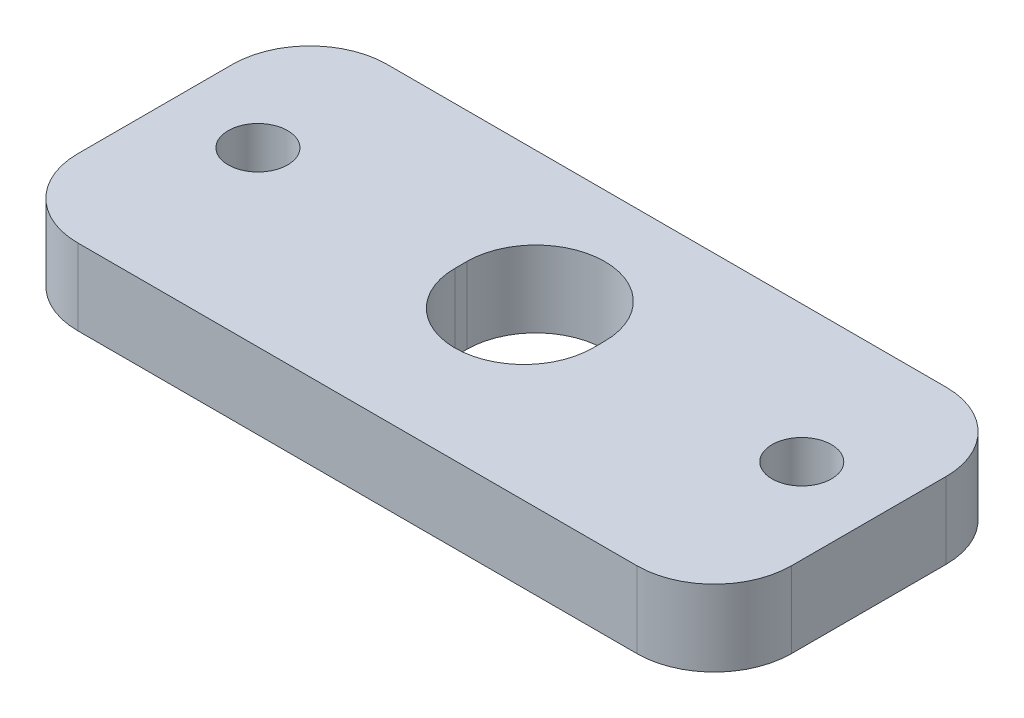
ISO-10303-21;
HEADER;
FILE_DESCRIPTION(('STEP AP214'),'2;1');
FILE_NAME('part.step','',(''),(''),'','','');
FILE_SCHEMA(('AUTOMOTIVE_DESIGN { 1 0 10303 214 1 1 1 1 }'));
ENDSEC;
DATA;
#1=APPLICATION_CONTEXT('core data for automotive mechanical design processes');
#2=APPLICATION_PROTOCOL_DEFINITION('international standard','automotive_design',2000,#1);
#3=PRODUCT_CONTEXT('',#1,'mechanical');
#4=PRODUCT('Part','Part','',(#3));
#5=PRODUCT_RELATED_PRODUCT_CATEGORY('part','',(#4));
#6=PRODUCT_DEFINITION_FORMATION('','',#4);
#7=PRODUCT_DEFINITION_CONTEXT('part definition',#1,'design');
#8=PRODUCT_DEFINITION('design','',#6,#7);
#9=PRODUCT_DEFINITION_SHAPE('','',#8);
#10=(LENGTH_UNIT() NAMED_UNIT(*) SI_UNIT(.MILLI.,.METRE.));
#11=(NAMED_UNIT(*) PLANE_ANGLE_UNIT() SI_UNIT($,.RADIAN.));
#12=(NAMED_UNIT(*) SI_UNIT($,.STERADIAN.) SOLID_ANGLE_UNIT());
#13=UNCERTAINTY_MEASURE_WITH_UNIT(LENGTH_MEASURE(1.E-05),#10,'distance_accuracy_value','');
#14=(GEOMETRIC_REPRESENTATION_CONTEXT(3) GLOBAL_UNCERTAINTY_ASSIGNED_CONTEXT((#13)) GLOBAL_UNIT_ASSIGNED_CONTEXT((#10,
#11,#12)) REPRESENTATION_CONTEXT('',''));
#15=CARTESIAN_POINT('',(0.,0.,0.));
#16=DIRECTION('',(0.,0.,1.));
#17=DIRECTION('',(1.,0.,0.));
#18=AXIS2_PLACEMENT_3D('',#15,#16,#17);
#19=CARTESIAN_POINT('',(0.,3.2,0.));
#20=DIRECTION('',(0.,1.,0.));
#21=DIRECTION('',(0.,0.,1.));
#22=AXIS2_PLACEMENT_3D('',#19,#20,#21);
#23=PLANE('',#22);
#24=CARTESIAN_POINT('',(-11.43,3.2,-0.750000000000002));
#25=DIRECTION('',(0.,1.,0.));
#26=DIRECTION('',(0.,0.,1.));
#27=AXIS2_PLACEMENT_3D('',#24,#25,#26);
#28=CIRCLE('',#27,1.25);
#29=CARTESIAN_POINT('',(-11.43,3.2,0.499999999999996));
#30=VERTEX_POINT('',#29);
#31=EDGE_CURVE('E252',#30,#30,#28,.T.);
#32=ORIENTED_EDGE('',*,*,#31,.F.);
#33=EDGE_LOOP('',(#32));
#34=FACE_BOUND('',#33,.T.);
#35=CARTESIAN_POINT('',(11.43,3.2,-0.750000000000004));
#36=DIRECTION('',(0.,1.,0.));
#37=DIRECTION('',(0.,0.,1.));
#38=AXIS2_PLACEMENT_3D('',#35,#36,#37);
#39=CIRCLE('',#38,1.25);
#40=CARTESIAN_POINT('',(11.43,3.2,0.499999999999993));
#41=VERTEX_POINT('',#40);
#42=EDGE_CURVE('E246',#41,#41,#39,.T.);
#43=ORIENTED_EDGE('',*,*,#42,.F.);
#44=EDGE_LOOP('',(#43));
#45=FACE_BOUND('',#44,.T.);
#46=CARTESIAN_POINT('',(0.,3.2,-0.500000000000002));
#47=DIRECTION('',(0.,1.,0.));
#48=DIRECTION('',(0.,0.,1.));
#49=AXIS2_PLACEMENT_3D('',#46,#47,#48);
#50=CIRCLE('',#49,2.9);
#51=CARTESIAN_POINT('',(-2.9,3.2,-0.5));
#52=VERTEX_POINT('',#51);
#53=CARTESIAN_POINT('',(2.9,3.2,-0.5));
#54=VERTEX_POINT('',#53);
#55=EDGE_CURVE('E160',#52,#54,#50,.T.);
#56=ORIENTED_EDGE('',*,*,#55,.F.);
#57=DIRECTION('',(0.,0.,1.));
#58=VECTOR('',#57,1.);
#59=CARTESIAN_POINT('',(-2.9,3.2,-0.5));
#60=LINE('',#59,#58);
#61=CARTESIAN_POINT('',(-2.9,3.2,-1.));
#62=VERTEX_POINT('',#61);
#63=EDGE_CURVE('E164',#62,#52,#60,.T.);
#64=ORIENTED_EDGE('',*,*,#63,.F.);
#65=CARTESIAN_POINT('',(0.,3.2,-1.));
#66=DIRECTION('',(0.,1.,0.));
#67=DIRECTION('',(0.,0.,1.));
#68=AXIS2_PLACEMENT_3D('',#65,#66,#67);
#69=CIRCLE('',#68,2.9);
#70=CARTESIAN_POINT('',(2.9,3.2,-1.));
#71=VERTEX_POINT('',#70);
#72=EDGE_CURVE('E166',#71,#62,#69,.T.);
#73=ORIENTED_EDGE('',*,*,#72,.F.);
#74=DIRECTION('',(0.,0.,-1.));
#75=VECTOR('',#74,1.);
#76=CARTESIAN_POINT('',(2.9,3.2,-0.5));
#77=LINE('',#76,#75);
#78=EDGE_CURVE('E175',#54,#71,#77,.T.);
#79=ORIENTED_EDGE('',*,*,#78,.F.);
#80=EDGE_LOOP('',(#56,#64,#73,#79));
#81=FACE_BOUND('',#80,.T.);
#82=DIRECTION('',(0.,0.,-1.));
#83=VECTOR('',#82,1.);
#84=CARTESIAN_POINT('',(15.,3.2,6.5));
#85=LINE('',#84,#83);
#86=CARTESIAN_POINT('',(15.,3.2,3.25));
#87=VERTEX_POINT('',#86);
#88=CARTESIAN_POINT('',(15.,3.2,-3.25));
#89=VERTEX_POINT('',#88);
#90=EDGE_CURVE('E233',#87,#89,#85,.T.);
#91=ORIENTED_EDGE('',*,*,#90,.T.);
#92=CARTESIAN_POINT('',(11.75,3.2,-3.25));
#93=DIRECTION('',(0.,1.,0.));
#94=DIRECTION('',(0.,0.,1.));
#95=AXIS2_PLACEMENT_3D('',#92,#93,#94);
#96=CIRCLE('',#95,3.25);
#97=CARTESIAN_POINT('',(11.75,3.2,-6.5));
#98=VERTEX_POINT('',#97);
#99=EDGE_CURVE('E196',#89,#98,#96,.T.);
#100=ORIENTED_EDGE('',*,*,#99,.T.);
#101=DIRECTION('',(-1.,0.,0.));
#102=VECTOR('',#101,1.);
#103=CARTESIAN_POINT('',(15.,3.2,-6.5));
#104=LINE('',#103,#102);
#105=CARTESIAN_POINT('',(-11.75,3.2,-6.5));
#106=VERTEX_POINT('',#105);
#107=EDGE_CURVE('E231',#98,#106,#104,.T.);
#108=ORIENTED_EDGE('',*,*,#107,.T.);
#109=CARTESIAN_POINT('',(-11.75,3.2,-3.25));
#110=DIRECTION('',(0.,1.,0.));
#111=DIRECTION('',(0.,0.,1.));
#112=AXIS2_PLACEMENT_3D('',#109,#110,#111);
#113=CIRCLE('',#112,3.25);
#114=CARTESIAN_POINT('',(-15.,3.2,-3.25));
#115=VERTEX_POINT('',#114);
#116=EDGE_CURVE('E194',#106,#115,#113,.T.);
#117=ORIENTED_EDGE('',*,*,#116,.T.);
#118=DIRECTION('',(0.,0.,1.));
#119=VECTOR('',#118,1.);
#120=CARTESIAN_POINT('',(-15.,3.2,-6.5));
#121=LINE('',#120,#119);
#122=CARTESIAN_POINT('',(-15.,3.2,3.25));
#123=VERTEX_POINT('',#122);
#124=EDGE_CURVE('E229',#115,#123,#121,.T.);
#125=ORIENTED_EDGE('',*,*,#124,.T.);
#126=CARTESIAN_POINT('',(-11.75,3.2,3.25));
#127=DIRECTION('',(0.,1.,0.));
#128=DIRECTION('',(0.,0.,1.));
#129=AXIS2_PLACEMENT_3D('',#126,#127,#128);
#130=CIRCLE('',#129,3.25);
#131=CARTESIAN_POINT('',(-11.75,3.2,6.5));
#132=VERTEX_POINT('',#131);
#133=EDGE_CURVE('E192',#123,#132,#130,.T.);
#134=ORIENTED_EDGE('',*,*,#133,.T.);
#135=DIRECTION('',(1.,0.,0.));
#136=VECTOR('',#135,1.);
#137=CARTESIAN_POINT('',(-15.,3.2,6.5));
#138=LINE('',#137,#136);
#139=CARTESIAN_POINT('',(11.75,3.2,6.5));
#140=VERTEX_POINT('',#139);
#141=EDGE_CURVE('E169',#132,#140,#138,.T.);
#142=ORIENTED_EDGE('',*,*,#141,.T.);
#143=CARTESIAN_POINT('',(11.75,3.2,3.25));
#144=DIRECTION('',(0.,1.,0.));
#145=DIRECTION('',(0.,0.,1.));
#146=AXIS2_PLACEMENT_3D('',#143,#144,#145);
#147=CIRCLE('',#146,3.25);
#148=EDGE_CURVE('E190',#140,#87,#147,.T.);
#149=ORIENTED_EDGE('',*,*,#148,.T.);
#150=EDGE_LOOP('',(#91,#100,#108,#117,#125,#134,#142,#149));
#151=FACE_BOUND('',#150,.T.);
#152=ADVANCED_FACE('F50',(#34,#45,#81,#151),#23,.T.);
#153=CARTESIAN_POINT('',(0.,0.,0.));
#154=DIRECTION('',(0.,1.,0.));
#155=DIRECTION('',(0.,0.,1.));
#156=AXIS2_PLACEMENT_3D('',#153,#154,#155);
#157=PLANE('',#156);
#158=CARTESIAN_POINT('',(-11.43,0.,-0.750000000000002));
#159=DIRECTION('',(0.,1.,0.));
#160=DIRECTION('',(0.,0.,1.));
#161=AXIS2_PLACEMENT_3D('',#158,#159,#160);
#162=CIRCLE('',#161,1.25);
#163=CARTESIAN_POINT('',(-11.43,0.,0.499999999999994));
#164=VERTEX_POINT('',#163);
#165=EDGE_CURVE('E249',#164,#164,#162,.T.);
#166=ORIENTED_EDGE('',*,*,#165,.T.);
#167=EDGE_LOOP('',(#166));
#168=FACE_BOUND('',#167,.T.);
#169=CARTESIAN_POINT('',(11.43,0.,-0.750000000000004));
#170=DIRECTION('',(0.,1.,0.));
#171=DIRECTION('',(0.,0.,1.));
#172=AXIS2_PLACEMENT_3D('',#169,#170,#171);
#173=CIRCLE('',#172,1.25);
#174=CARTESIAN_POINT('',(11.43,0.,0.499999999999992));
#175=VERTEX_POINT('',#174);
#176=EDGE_CURVE('E237',#175,#175,#173,.T.);
#177=ORIENTED_EDGE('',*,*,#176,.T.);
#178=EDGE_LOOP('',(#177));
#179=FACE_BOUND('',#178,.T.);
#180=CARTESIAN_POINT('',(0.,0.,-1.));
#181=DIRECTION('',(0.,1.,0.));
#182=DIRECTION('',(0.,0.,1.));
#183=AXIS2_PLACEMENT_3D('',#180,#181,#182);
#184=CIRCLE('',#183,2.9);
#185=CARTESIAN_POINT('',(2.9,0.,-1.));
#186=VERTEX_POINT('',#185);
#187=CARTESIAN_POINT('',(-2.9,0.,-1.));
#188=VERTEX_POINT('',#187);
#189=EDGE_CURVE('E151',#186,#188,#184,.T.);
#190=ORIENTED_EDGE('',*,*,#189,.T.);
#191=DIRECTION('',(0.,0.,1.));
#192=VECTOR('',#191,1.);
#193=CARTESIAN_POINT('',(-2.9,0.,-0.5));
#194=LINE('',#193,#192);
#195=CARTESIAN_POINT('',(-2.9,0.,-0.5));
#196=VERTEX_POINT('',#195);
#197=EDGE_CURVE('E161',#188,#196,#194,.T.);
#198=ORIENTED_EDGE('',*,*,#197,.T.);
#199=CARTESIAN_POINT('',(0.,0.,-0.500000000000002));
#200=DIRECTION('',(0.,1.,0.));
#201=DIRECTION('',(0.,0.,1.));
#202=AXIS2_PLACEMENT_3D('',#199,#200,#201);
#203=CIRCLE('',#202,2.9);
#204=CARTESIAN_POINT('',(2.9,0.,-0.5));
#205=VERTEX_POINT('',#204);
#206=EDGE_CURVE('E152',#196,#205,#203,.T.);
#207=ORIENTED_EDGE('',*,*,#206,.T.);
#208=DIRECTION('',(0.,0.,-1.));
#209=VECTOR('',#208,1.);
#210=CARTESIAN_POINT('',(2.9,0.,-0.5));
#211=LINE('',#210,#209);
#212=EDGE_CURVE('E141',#205,#186,#211,.T.);
#213=ORIENTED_EDGE('',*,*,#212,.T.);
#214=EDGE_LOOP('',(#190,#198,#207,#213));
#215=FACE_BOUND('',#214,.T.);
#216=DIRECTION('',(1.,0.,0.));
#217=VECTOR('',#216,1.);
#218=CARTESIAN_POINT('',(15.,0.,-6.5));
#219=LINE('',#218,#217);
#220=CARTESIAN_POINT('',(-11.75,0.,-6.5));
#221=VERTEX_POINT('',#220);
#222=CARTESIAN_POINT('',(11.75,0.,-6.5));
#223=VERTEX_POINT('',#222);
#224=EDGE_CURVE('E176',#221,#223,#219,.T.);
#225=ORIENTED_EDGE('',*,*,#224,.T.);
#226=CARTESIAN_POINT('',(11.75,0.,-3.25));
#227=DIRECTION('',(0.,1.,0.));
#228=DIRECTION('',(0.,0.,1.));
#229=AXIS2_PLACEMENT_3D('',#226,#227,#228);
#230=CIRCLE('',#229,3.25);
#231=CARTESIAN_POINT('',(15.,0.,-3.25));
#232=VERTEX_POINT('',#231);
#233=EDGE_CURVE('E208',#223,#232,#230,.F.);
#234=ORIENTED_EDGE('',*,*,#233,.T.);
#235=DIRECTION('',(0.,0.,1.));
#236=VECTOR('',#235,1.);
#237=CARTESIAN_POINT('',(15.,0.,6.5));
#238=LINE('',#237,#236);
#239=CARTESIAN_POINT('',(15.,0.,3.25));
#240=VERTEX_POINT('',#239);
#241=EDGE_CURVE('E238',#232,#240,#238,.T.);
#242=ORIENTED_EDGE('',*,*,#241,.T.);
#243=CARTESIAN_POINT('',(11.75,0.,3.25));
#244=DIRECTION('',(0.,1.,0.));
#245=DIRECTION('',(0.,0.,1.));
#246=AXIS2_PLACEMENT_3D('',#243,#244,#245);
#247=CIRCLE('',#246,3.25);
#248=CARTESIAN_POINT('',(11.75,0.,6.5));
#249=VERTEX_POINT('',#248);
#250=EDGE_CURVE('E203',#240,#249,#247,.F.);
#251=ORIENTED_EDGE('',*,*,#250,.T.);
#252=DIRECTION('',(-1.,0.,0.));
#253=VECTOR('',#252,1.);
#254=CARTESIAN_POINT('',(-15.,0.,6.5));
#255=LINE('',#254,#253);
#256=CARTESIAN_POINT('',(-11.75,0.,6.5));
#257=VERTEX_POINT('',#256);
#258=EDGE_CURVE('E221',#249,#257,#255,.T.);
#259=ORIENTED_EDGE('',*,*,#258,.T.);
#260=CARTESIAN_POINT('',(-11.75,0.,3.25));
#261=DIRECTION('',(0.,1.,0.));
#262=DIRECTION('',(0.,0.,1.));
#263=AXIS2_PLACEMENT_3D('',#260,#261,#262);
#264=CIRCLE('',#263,3.25);
#265=CARTESIAN_POINT('',(-15.,0.,3.25));
#266=VERTEX_POINT('',#265);
#267=EDGE_CURVE('E72',#257,#266,#264,.F.);
#268=ORIENTED_EDGE('',*,*,#267,.T.);
#269=DIRECTION('',(0.,0.,-1.));
#270=VECTOR('',#269,1.);
#271=CARTESIAN_POINT('',(-15.,0.,-6.5));
#272=LINE('',#271,#270);
#273=CARTESIAN_POINT('',(-15.,0.,-3.25));
#274=VERTEX_POINT('',#273);
#275=EDGE_CURVE('E228',#266,#274,#272,.T.);
#276=ORIENTED_EDGE('',*,*,#275,.T.);
#277=CARTESIAN_POINT('',(-11.75,0.,-3.25));
#278=DIRECTION('',(0.,1.,0.));
#279=DIRECTION('',(0.,0.,1.));
#280=AXIS2_PLACEMENT_3D('',#277,#278,#279);
#281=CIRCLE('',#280,3.25);
#282=EDGE_CURVE('E206',#274,#221,#281,.F.);
#283=ORIENTED_EDGE('',*,*,#282,.T.);
#284=EDGE_LOOP('',(#225,#234,#242,#251,#259,#268,#276,#283));
#285=FACE_BOUND('',#284,.T.);
#286=ADVANCED_FACE('F163',(#168,#179,#215,#285),#157,.F.);
#287=CARTESIAN_POINT('',(-2.9,0.,-0.5));
#288=DIRECTION('',(-1.,0.,0.));
#289=DIRECTION('',(0.,0.,1.));
#290=AXIS2_PLACEMENT_3D('',#287,#288,#289);
#291=PLANE('',#290);
#292=ORIENTED_EDGE('',*,*,#63,.T.);
#293=DIRECTION('',(0.,1.,0.));
#294=VECTOR('',#293,1.);
#295=CARTESIAN_POINT('',(-2.9,0.,-0.5));
#296=LINE('',#295,#294);
#297=EDGE_CURVE('E180',#196,#52,#296,.T.);
#298=ORIENTED_EDGE('',*,*,#297,.F.);
#299=ORIENTED_EDGE('',*,*,#197,.F.);
#300=DIRECTION('',(0.,1.,0.));
#301=VECTOR('',#300,1.);
#302=CARTESIAN_POINT('',(-2.9,0.,-1.));
#303=LINE('',#302,#301);
#304=EDGE_CURVE('E183',#188,#62,#303,.T.);
#305=ORIENTED_EDGE('',*,*,#304,.T.);
#306=EDGE_LOOP('',(#292,#298,#299,#305));
#307=FACE_BOUND('',#306,.T.);
#308=ADVANCED_FACE('F269',(#307),#291,.F.);
#309=CARTESIAN_POINT('',(2.9,0.,-0.5));
#310=DIRECTION('',(1.,0.,0.));
#311=DIRECTION('',(0.,0.,-1.));
#312=AXIS2_PLACEMENT_3D('',#309,#310,#311);
#313=PLANE('',#312);
#314=ORIENTED_EDGE('',*,*,#78,.T.);
#315=DIRECTION('',(0.,1.,0.));
#316=VECTOR('',#315,1.);
#317=CARTESIAN_POINT('',(2.9,0.,-1.));
#318=LINE('',#317,#316);
#319=EDGE_CURVE('E147',#186,#71,#318,.T.);
#320=ORIENTED_EDGE('',*,*,#319,.F.);
#321=ORIENTED_EDGE('',*,*,#212,.F.);
#322=DIRECTION('',(0.,1.,0.));
#323=VECTOR('',#322,1.);
#324=CARTESIAN_POINT('',(2.9,0.,-0.5));
#325=LINE('',#324,#323);
#326=EDGE_CURVE('E144',#205,#54,#325,.T.);
#327=ORIENTED_EDGE('',*,*,#326,.T.);
#328=EDGE_LOOP('',(#314,#320,#321,#327));
#329=FACE_BOUND('',#328,.T.);
#330=ADVANCED_FACE('F143',(#329),#313,.F.);
#331=CARTESIAN_POINT('',(0.,0.,-0.500000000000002));
#332=DIRECTION('',(0.,1.,0.));
#333=DIRECTION('',(0.,0.,1.));
#334=AXIS2_PLACEMENT_3D('',#331,#332,#333);
#335=CYLINDRICAL_SURFACE('',#334,2.9);
#336=ORIENTED_EDGE('',*,*,#55,.T.);
#337=ORIENTED_EDGE('',*,*,#326,.F.);
#338=ORIENTED_EDGE('',*,*,#206,.F.);
#339=ORIENTED_EDGE('',*,*,#297,.T.);
#340=EDGE_LOOP('',(#336,#337,#338,#339));
#341=FACE_BOUND('',#340,.T.);
#342=ADVANCED_FACE('F156',(#341),#335,.F.);
#343=CARTESIAN_POINT('',(0.,0.,-1.));
#344=DIRECTION('',(0.,1.,0.));
#345=DIRECTION('',(0.,0.,1.));
#346=AXIS2_PLACEMENT_3D('',#343,#344,#345);
#347=CYLINDRICAL_SURFACE('',#346,2.9);
#348=ORIENTED_EDGE('',*,*,#72,.T.);
#349=ORIENTED_EDGE('',*,*,#304,.F.);
#350=ORIENTED_EDGE('',*,*,#189,.F.);
#351=ORIENTED_EDGE('',*,*,#319,.T.);
#352=EDGE_LOOP('',(#348,#349,#350,#351));
#353=FACE_BOUND('',#352,.T.);
#354=ADVANCED_FACE('F266',(#353),#347,.F.);
#355=CARTESIAN_POINT('',(15.,-32.6955654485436,-6.5));
#356=DIRECTION('',(0.,0.,-1.));
#357=DIRECTION('',(-1.,0.,0.));
#358=AXIS2_PLACEMENT_3D('',#355,#356,#357);
#359=PLANE('',#358);
#360=ORIENTED_EDGE('',*,*,#107,.F.);
#361=DIRECTION('',(0.,1.,0.));
#362=VECTOR('',#361,1.);
#363=CARTESIAN_POINT('',(11.75,-32.6955654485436,-6.5));
#364=LINE('',#363,#362);
#365=EDGE_CURVE('E201',#98,#223,#364,.F.);
#366=ORIENTED_EDGE('',*,*,#365,.T.);
#367=ORIENTED_EDGE('',*,*,#224,.F.);
#368=DIRECTION('',(0.,1.,0.));
#369=VECTOR('',#368,1.);
#370=CARTESIAN_POINT('',(-11.75,-32.6955654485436,-6.5));
#371=LINE('',#370,#369);
#372=EDGE_CURVE('E198',#221,#106,#371,.T.);
#373=ORIENTED_EDGE('',*,*,#372,.T.);
#374=EDGE_LOOP('',(#360,#366,#367,#373));
#375=FACE_BOUND('',#374,.T.);
#376=ADVANCED_FACE('F284',(#375),#359,.T.);
#377=CARTESIAN_POINT('',(-15.,-32.6955654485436,-6.5));
#378=DIRECTION('',(-1.,0.,0.));
#379=DIRECTION('',(0.,0.,1.));
#380=AXIS2_PLACEMENT_3D('',#377,#378,#379);
#381=PLANE('',#380);
#382=ORIENTED_EDGE('',*,*,#124,.F.);
#383=DIRECTION('',(0.,1.,0.));
#384=VECTOR('',#383,1.);
#385=CARTESIAN_POINT('',(-15.,-32.6955654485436,-3.25));
#386=LINE('',#385,#384);
#387=EDGE_CURVE('E65',#115,#274,#386,.F.);
#388=ORIENTED_EDGE('',*,*,#387,.T.);
#389=ORIENTED_EDGE('',*,*,#275,.F.);
#390=DIRECTION('',(0.,1.,0.));
#391=VECTOR('',#390,1.);
#392=CARTESIAN_POINT('',(-15.,-32.6955654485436,3.25));
#393=LINE('',#392,#391);
#394=EDGE_CURVE('E210',#266,#123,#393,.T.);
#395=ORIENTED_EDGE('',*,*,#394,.T.);
#396=EDGE_LOOP('',(#382,#388,#389,#395));
#397=FACE_BOUND('',#396,.T.);
#398=ADVANCED_FACE('F303',(#397),#381,.T.);
#399=CARTESIAN_POINT('',(-15.,-32.6955654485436,6.5));
#400=DIRECTION('',(0.,0.,1.));
#401=DIRECTION('',(1.,0.,0.));
#402=AXIS2_PLACEMENT_3D('',#399,#400,#401);
#403=PLANE('',#402);
#404=ORIENTED_EDGE('',*,*,#141,.F.);
#405=DIRECTION('',(0.,1.,0.));
#406=VECTOR('',#405,1.);
#407=CARTESIAN_POINT('',(-11.75,-32.6955654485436,6.5));
#408=LINE('',#407,#406);
#409=EDGE_CURVE('E13',#132,#257,#408,.F.);
#410=ORIENTED_EDGE('',*,*,#409,.T.);
#411=ORIENTED_EDGE('',*,*,#258,.F.);
#412=DIRECTION('',(0.,1.,0.));
#413=VECTOR('',#412,1.);
#414=CARTESIAN_POINT('',(11.75,-32.6955654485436,6.5));
#415=LINE('',#414,#413);
#416=EDGE_CURVE('E58',#249,#140,#415,.T.);
#417=ORIENTED_EDGE('',*,*,#416,.T.);
#418=EDGE_LOOP('',(#404,#410,#411,#417));
#419=FACE_BOUND('',#418,.T.);
#420=ADVANCED_FACE('F219',(#419),#403,.T.);
#421=CARTESIAN_POINT('',(15.,-32.6955654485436,6.5));
#422=DIRECTION('',(1.,0.,0.));
#423=DIRECTION('',(0.,0.,-1.));
#424=AXIS2_PLACEMENT_3D('',#421,#422,#423);
#425=PLANE('',#424);
#426=ORIENTED_EDGE('',*,*,#241,.F.);
#427=DIRECTION('',(0.,1.,0.));
#428=VECTOR('',#427,1.);
#429=CARTESIAN_POINT('',(15.,-32.6955654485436,-3.25));
#430=LINE('',#429,#428);
#431=EDGE_CURVE('E187',#232,#89,#430,.T.);
#432=ORIENTED_EDGE('',*,*,#431,.T.);
#433=ORIENTED_EDGE('',*,*,#90,.F.);
#434=DIRECTION('',(0.,1.,0.));
#435=VECTOR('',#434,1.);
#436=CARTESIAN_POINT('',(15.,-32.6955654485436,3.25));
#437=LINE('',#436,#435);
#438=EDGE_CURVE('E182',#87,#240,#437,.F.);
#439=ORIENTED_EDGE('',*,*,#438,.T.);
#440=EDGE_LOOP('',(#426,#432,#433,#439));
#441=FACE_BOUND('',#440,.T.);
#442=ADVANCED_FACE('F281',(#441),#425,.T.);
#443=CARTESIAN_POINT('',(11.75,-32.6955654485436,-3.25));
#444=DIRECTION('',(0.,1.,0.));
#445=DIRECTION('',(0.,0.,1.));
#446=AXIS2_PLACEMENT_3D('',#443,#444,#445);
#447=CYLINDRICAL_SURFACE('',#446,3.25);
#448=ORIENTED_EDGE('',*,*,#233,.F.);
#449=ORIENTED_EDGE('',*,*,#365,.F.);
#450=ORIENTED_EDGE('',*,*,#99,.F.);
#451=ORIENTED_EDGE('',*,*,#431,.F.);
#452=EDGE_LOOP('',(#448,#449,#450,#451));
#453=FACE_BOUND('',#452,.T.);
#454=ADVANCED_FACE('F288',(#453),#447,.T.);
#455=CARTESIAN_POINT('',(-11.75,-32.6955654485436,-3.25));
#456=DIRECTION('',(0.,1.,0.));
#457=DIRECTION('',(0.,0.,1.));
#458=AXIS2_PLACEMENT_3D('',#455,#456,#457);
#459=CYLINDRICAL_SURFACE('',#458,3.25);
#460=ORIENTED_EDGE('',*,*,#282,.F.);
#461=ORIENTED_EDGE('',*,*,#387,.F.);
#462=ORIENTED_EDGE('',*,*,#116,.F.);
#463=ORIENTED_EDGE('',*,*,#372,.F.);
#464=EDGE_LOOP('',(#460,#461,#462,#463));
#465=FACE_BOUND('',#464,.T.);
#466=ADVANCED_FACE('F291',(#465),#459,.T.);
#467=CARTESIAN_POINT('',(-11.75,-32.6955654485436,3.25));
#468=DIRECTION('',(0.,1.,0.));
#469=DIRECTION('',(0.,0.,1.));
#470=AXIS2_PLACEMENT_3D('',#467,#468,#469);
#471=CYLINDRICAL_SURFACE('',#470,3.25);
#472=ORIENTED_EDGE('',*,*,#267,.F.);
#473=ORIENTED_EDGE('',*,*,#409,.F.);
#474=ORIENTED_EDGE('',*,*,#133,.F.);
#475=ORIENTED_EDGE('',*,*,#394,.F.);
#476=EDGE_LOOP('',(#472,#473,#474,#475));
#477=FACE_BOUND('',#476,.T.);
#478=ADVANCED_FACE('F294',(#477),#471,.T.);
#479=CARTESIAN_POINT('',(11.75,-32.6955654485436,3.25));
#480=DIRECTION('',(0.,1.,0.));
#481=DIRECTION('',(0.,0.,1.));
#482=AXIS2_PLACEMENT_3D('',#479,#480,#481);
#483=CYLINDRICAL_SURFACE('',#482,3.25);
#484=ORIENTED_EDGE('',*,*,#250,.F.);
#485=ORIENTED_EDGE('',*,*,#438,.F.);
#486=ORIENTED_EDGE('',*,*,#148,.F.);
#487=ORIENTED_EDGE('',*,*,#416,.F.);
#488=EDGE_LOOP('',(#484,#485,#486,#487));
#489=FACE_BOUND('',#488,.T.);
#490=ADVANCED_FACE('F52',(#489),#483,.T.);
#491=CARTESIAN_POINT('',(11.43,3.2,-0.750000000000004));
#492=DIRECTION('',(0.,1.,0.));
#493=DIRECTION('',(0.,0.,1.));
#494=AXIS2_PLACEMENT_3D('',#491,#492,#493);
#495=CYLINDRICAL_SURFACE('',#494,1.25);
#496=ORIENTED_EDGE('',*,*,#176,.F.);
#497=EDGE_LOOP('',(#496));
#498=FACE_BOUND('',#497,.T.);
#499=ORIENTED_EDGE('',*,*,#42,.T.);
#500=EDGE_LOOP('',(#499));
#501=FACE_BOUND('',#500,.T.);
#502=ADVANCED_FACE('F301',(#498,#501),#495,.F.);
#503=CARTESIAN_POINT('',(-11.43,3.2,-0.750000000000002));
#504=DIRECTION('',(0.,1.,0.));
#505=DIRECTION('',(0.,0.,1.));
#506=AXIS2_PLACEMENT_3D('',#503,#504,#505);
#507=CYLINDRICAL_SURFACE('',#506,1.25);
#508=ORIENTED_EDGE('',*,*,#165,.F.);
#509=EDGE_LOOP('',(#508));
#510=FACE_BOUND('',#509,.T.);
#511=ORIENTED_EDGE('',*,*,#31,.T.);
#512=EDGE_LOOP('',(#511));
#513=FACE_BOUND('',#512,.T.);
#514=ADVANCED_FACE('F256',(#510,#513),#507,.F.);
#515=CLOSED_SHELL('',(#152,#286,#308,#330,#342,#354,#376,#398,#420,#442,#454,#466,#478,#490,
#502,#514));
#516=MANIFOLD_SOLID_BREP('B2',#515);
#517=ADVANCED_BREP_SHAPE_REPRESENTATION('',(#18,#516),#14);
#518=SHAPE_DEFINITION_REPRESENTATION(#9,#517);
ENDSEC;
END-ISO-10303-21;
